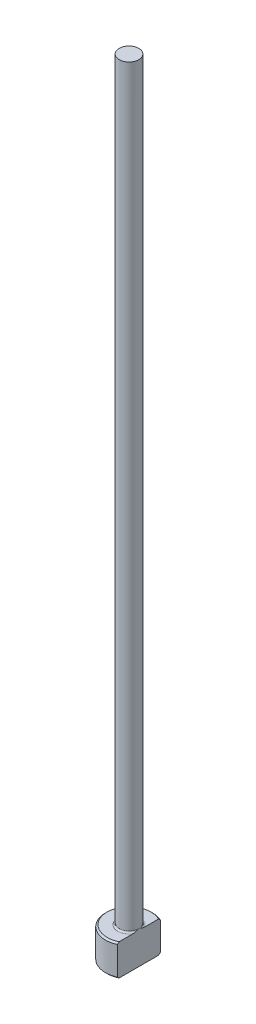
ISO-10303-21;
HEADER;
FILE_DESCRIPTION(('STEP AP214'),'2;1');
FILE_NAME('part.step','',(''),(''),'','','');
FILE_SCHEMA(('AUTOMOTIVE_DESIGN { 1 0 10303 214 1 1 1 1 }'));
ENDSEC;
DATA;
#1=APPLICATION_CONTEXT('core data for automotive mechanical design processes');
#2=APPLICATION_PROTOCOL_DEFINITION('international standard','automotive_design',2000,#1);
#3=PRODUCT_CONTEXT('',#1,'mechanical');
#4=PRODUCT('Part','Part','',(#3));
#5=PRODUCT_RELATED_PRODUCT_CATEGORY('part','',(#4));
#6=PRODUCT_DEFINITION_FORMATION('','',#4);
#7=PRODUCT_DEFINITION_CONTEXT('part definition',#1,'design');
#8=PRODUCT_DEFINITION('design','',#6,#7);
#9=PRODUCT_DEFINITION_SHAPE('','',#8);
#10=(LENGTH_UNIT() NAMED_UNIT(*) SI_UNIT(.MILLI.,.METRE.));
#11=(NAMED_UNIT(*) PLANE_ANGLE_UNIT() SI_UNIT($,.RADIAN.));
#12=(NAMED_UNIT(*) SI_UNIT($,.STERADIAN.) SOLID_ANGLE_UNIT());
#13=UNCERTAINTY_MEASURE_WITH_UNIT(LENGTH_MEASURE(1.E-05),#10,'distance_accuracy_value','');
#14=(GEOMETRIC_REPRESENTATION_CONTEXT(3) GLOBAL_UNCERTAINTY_ASSIGNED_CONTEXT((#13)) GLOBAL_UNIT_ASSIGNED_CONTEXT((#10,
#11,#12)) REPRESENTATION_CONTEXT('',''));
#15=CARTESIAN_POINT('',(0.,0.,0.));
#16=DIRECTION('',(0.,0.,1.));
#17=DIRECTION('',(1.,0.,0.));
#18=AXIS2_PLACEMENT_3D('',#15,#16,#17);
#19=CARTESIAN_POINT('',(0.,0.,0.));
#20=DIRECTION('',(0.,-1.,0.));
#21=DIRECTION('',(0.,0.,-1.));
#22=AXIS2_PLACEMENT_3D('',#19,#20,#21);
#23=PLANE('',#22);
#24=CARTESIAN_POINT('',(0.,0.,0.));
#25=DIRECTION('',(0.,-1.,0.));
#26=DIRECTION('',(0.,0.,-1.));
#27=AXIS2_PLACEMENT_3D('',#24,#25,#26);
#28=CIRCLE('',#27,2.79999999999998);
#29=CARTESIAN_POINT('',(1.24999999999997,0.,2.50549396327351));
#30=VERTEX_POINT('',#29);
#31=CARTESIAN_POINT('',(1.24999999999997,0.,-2.50549396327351));
#32=VERTEX_POINT('',#31);
#33=EDGE_CURVE('E98',#30,#32,#28,.T.);
#34=ORIENTED_EDGE('',*,*,#33,.T.);
#35=DIRECTION('',(0.,0.,1.));
#36=VECTOR('',#35,1.);
#37=CARTESIAN_POINT('',(1.24999999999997,0.,2.72717802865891));
#38=LINE('',#37,#36);
#39=EDGE_CURVE('E83',#32,#30,#38,.T.);
#40=ORIENTED_EDGE('',*,*,#39,.T.);
#41=EDGE_LOOP('',(#34,#40));
#42=FACE_BOUND('',#41,.T.);
#43=ADVANCED_FACE('F32',(#42),#23,.T.);
#44=CARTESIAN_POINT('',(0.,259.958771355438,0.));
#45=DIRECTION('',(0.,1.,0.));
#46=DIRECTION('',(0.,0.,1.));
#47=AXIS2_PLACEMENT_3D('',#44,#45,#46);
#48=CYLINDRICAL_SURFACE('',#47,2.99999999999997);
#49=CARTESIAN_POINT('',(0.,3.80000000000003,0.));
#50=DIRECTION('',(0.,1.,0.));
#51=DIRECTION('',(0.,0.,1.));
#52=AXIS2_PLACEMENT_3D('',#49,#50,#51);
#53=CIRCLE('',#52,2.99999999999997);
#54=CARTESIAN_POINT('',(1.24999999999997,3.80000000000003,2.72717802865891));
#55=VERTEX_POINT('',#54);
#56=CARTESIAN_POINT('',(1.24999999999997,3.80000000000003,-2.72717802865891));
#57=VERTEX_POINT('',#56);
#58=EDGE_CURVE('E104',#55,#57,#53,.F.);
#59=ORIENTED_EDGE('',*,*,#58,.T.);
#60=DIRECTION('',(0.,-1.,0.));
#61=VECTOR('',#60,1.);
#62=CARTESIAN_POINT('',(1.24999999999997,100.,-2.72717802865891));
#63=LINE('',#62,#61);
#64=CARTESIAN_POINT('',(1.24999999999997,0.199999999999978,-2.72717802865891));
#65=VERTEX_POINT('',#64);
#66=EDGE_CURVE('E183',#57,#65,#63,.T.);
#67=ORIENTED_EDGE('',*,*,#66,.T.);
#68=CARTESIAN_POINT('',(0.,0.199999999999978,0.));
#69=DIRECTION('',(0.,-1.,0.));
#70=DIRECTION('',(0.,0.,-1.));
#71=AXIS2_PLACEMENT_3D('',#68,#69,#70);
#72=CIRCLE('',#71,2.99999999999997);
#73=CARTESIAN_POINT('',(1.24999999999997,0.199999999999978,2.72717802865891));
#74=VERTEX_POINT('',#73);
#75=EDGE_CURVE('E100',#65,#74,#72,.F.);
#76=ORIENTED_EDGE('',*,*,#75,.T.);
#77=DIRECTION('',(0.,-1.,0.));
#78=VECTOR('',#77,1.);
#79=CARTESIAN_POINT('',(1.24999999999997,100.,2.72717802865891));
#80=LINE('',#79,#78);
#81=EDGE_CURVE('E93',#55,#74,#80,.T.);
#82=ORIENTED_EDGE('',*,*,#81,.F.);
#83=EDGE_LOOP('',(#59,#67,#76,#82));
#84=FACE_BOUND('',#83,.T.);
#85=ADVANCED_FACE('F158',(#84),#48,.T.);
#86=CARTESIAN_POINT('',(-2.99999999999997,4.,0.));
#87=DIRECTION('',(0.,1.,0.));
#88=DIRECTION('',(0.,0.,1.));
#89=AXIS2_PLACEMENT_3D('',#86,#87,#88);
#90=PLANE('',#89);
#91=CARTESIAN_POINT('',(0.,4.,0.));
#92=DIRECTION('',(0.,1.,0.));
#93=DIRECTION('',(0.,0.,1.));
#94=AXIS2_PLACEMENT_3D('',#91,#92,#93);
#95=CIRCLE('',#94,2.8);
#96=CARTESIAN_POINT('',(1.24999999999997,4.,-2.50549396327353));
#97=VERTEX_POINT('',#96);
#98=CARTESIAN_POINT('',(1.24999999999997,4.,2.50549396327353));
#99=VERTEX_POINT('',#98);
#100=EDGE_CURVE('E178',#97,#99,#95,.T.);
#101=ORIENTED_EDGE('',*,*,#100,.T.);
#102=DIRECTION('',(0.,0.,-1.));
#103=VECTOR('',#102,1.);
#104=CARTESIAN_POINT('',(1.24999999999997,4.,0.));
#105=LINE('',#104,#103);
#106=CARTESIAN_POINT('',(1.24999999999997,3.99999999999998,0.734846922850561));
#107=VERTEX_POINT('',#106);
#108=EDGE_CURVE('E57',#99,#107,#105,.T.);
#109=ORIENTED_EDGE('',*,*,#108,.T.);
#110=CARTESIAN_POINT('',(0.,4.,0.));
#111=DIRECTION('',(0.,1.,0.));
#112=DIRECTION('',(0.,0.,1.));
#113=AXIS2_PLACEMENT_3D('',#110,#111,#112);
#114=CIRCLE('',#113,1.44999999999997);
#115=CARTESIAN_POINT('',(1.24999999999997,3.99999999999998,-0.734846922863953));
#116=VERTEX_POINT('',#115);
#117=EDGE_CURVE('E107',#107,#116,#114,.F.);
#118=ORIENTED_EDGE('',*,*,#117,.T.);
#119=EDGE_CURVE('E136',#116,#97,#105,.T.);
#120=ORIENTED_EDGE('',*,*,#119,.T.);
#121=EDGE_LOOP('',(#101,#109,#118,#120));
#122=FACE_BOUND('',#121,.T.);
#123=ADVANCED_FACE('F147',(#122),#90,.T.);
#124=CARTESIAN_POINT('',(0.,4.,0.));
#125=DIRECTION('',(0.,-1.,0.));
#126=DIRECTION('',(0.,0.,-1.));
#127=AXIS2_PLACEMENT_3D('',#124,#125,#126);
#128=CONICAL_SURFACE('',#127,2.8,0.785398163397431);
#129=ORIENTED_EDGE('',*,*,#58,.F.);
#130=CARTESIAN_POINT('',(1.24999999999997,0.669029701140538,6.00219100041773));
#131=CARTESIAN_POINT('',(1.24999999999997,0.811608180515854,5.85654654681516));
#132=CARTESIAN_POINT('',(1.24999999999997,0.954083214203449,5.71080056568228));
#133=CARTESIAN_POINT('',(1.24999999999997,1.23900024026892,5.41878816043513));
#134=CARTESIAN_POINT('',(1.24999999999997,1.38144175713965,5.27252127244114));
#135=CARTESIAN_POINT('',(1.24999999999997,1.67009506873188,4.97540906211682));
#136=CARTESIAN_POINT('',(1.24999999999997,1.81629662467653,4.82455378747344));
#137=CARTESIAN_POINT('',(1.24999999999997,2.10796282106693,4.52263591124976));
#138=CARTESIAN_POINT('',(1.24999999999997,2.2534282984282,4.37157411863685));
#139=CARTESIAN_POINT('',(1.24999999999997,2.53664042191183,4.07620034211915));
#140=CARTESIAN_POINT('',(1.24999999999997,2.67441792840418,3.93191797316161));
#141=CARTESIAN_POINT('',(1.24999999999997,2.94919792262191,3.64255917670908));
#142=CARTESIAN_POINT('',(1.24999999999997,3.08620024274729,3.49748258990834));
#143=CARTESIAN_POINT('',(1.24999999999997,3.36003302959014,3.2052316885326));
#144=CARTESIAN_POINT('',(1.24999999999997,3.49685542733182,3.05804979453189));
#145=CARTESIAN_POINT('',(1.24999999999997,3.76866895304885,2.76222351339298));
#146=CARTESIAN_POINT('',(1.24999999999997,3.9036614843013,2.61358041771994));
#147=CARTESIAN_POINT('',(1.24999999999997,4.16725075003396,2.31803303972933));
#148=CARTESIAN_POINT('',(1.24999999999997,4.29592101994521,2.17119494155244));
#149=CARTESIAN_POINT('',(1.24999999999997,4.48585031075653,1.94789558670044));
#150=CARTESIAN_POINT('',(1.24999999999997,4.54874737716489,1.87283059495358));
#151=CARTESIAN_POINT('',(1.24999999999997,4.67301560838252,1.72146479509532));
#152=CARTESIAN_POINT('',(1.24999999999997,4.73438704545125,1.64516421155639));
#153=CARTESIAN_POINT('',(1.24999999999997,4.85417557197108,1.49197305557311));
#154=CARTESIAN_POINT('',(1.24999999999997,4.91262187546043,1.41510543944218));
#155=CARTESIAN_POINT('',(1.24999999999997,5.02658525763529,1.25910555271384));
#156=CARTESIAN_POINT('',(1.24999999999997,5.08209990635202,1.17997148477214));
#157=CARTESIAN_POINT('',(1.24999999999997,5.18831713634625,1.0191471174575));
#158=CARTESIAN_POINT('',(1.24999999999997,5.23904487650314,0.937473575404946));
#159=CARTESIAN_POINT('',(1.24999999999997,5.33341065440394,0.770163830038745));
#160=CARTESIAN_POINT('',(1.24999999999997,5.37706287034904,0.684536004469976));
#161=CARTESIAN_POINT('',(1.24999999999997,5.42311846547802,0.577571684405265));
#162=CARTESIAN_POINT('',(1.24999999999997,5.43098597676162,0.558575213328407));
#163=CARTESIAN_POINT('',(1.24999999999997,5.44613719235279,0.520340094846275));
#164=CARTESIAN_POINT('',(1.24999999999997,5.45342063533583,0.501101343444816));
#165=CARTESIAN_POINT('',(1.24999999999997,5.46734064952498,0.462392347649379));
#166=CARTESIAN_POINT('',(1.24999999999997,5.47397728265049,0.442922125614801));
#167=CARTESIAN_POINT('',(1.24999999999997,5.48654090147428,0.403756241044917));
#168=CARTESIAN_POINT('',(1.24999999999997,5.49246793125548,0.384060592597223));
#169=CARTESIAN_POINT('',(1.24999999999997,5.50889838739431,0.325328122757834));
#170=CARTESIAN_POINT('',(1.24999999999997,5.51829705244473,0.285972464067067));
#171=CARTESIAN_POINT('',(1.24999999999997,5.53364447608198,0.206573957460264));
#172=CARTESIAN_POINT('',(1.24999999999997,5.53959211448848,0.166530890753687));
#173=CARTESIAN_POINT('',(1.24999999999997,5.54775364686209,0.0853257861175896));
#174=CARTESIAN_POINT('',(1.24999999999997,5.54989812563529,0.0441566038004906));
#175=CARTESIAN_POINT('',(1.24999999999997,5.5500947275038,-0.0381787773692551));
#176=CARTESIAN_POINT('',(1.24999999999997,5.54814807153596,-0.0793449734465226));
#177=CARTESIAN_POINT('',(1.24999999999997,5.54028608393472,-0.161410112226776));
#178=CARTESIAN_POINT('',(1.24999999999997,5.53435930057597,-0.202307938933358));
#179=CARTESIAN_POINT('',(1.24999999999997,5.51889139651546,-0.283420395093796));
#180=CARTESIAN_POINT('',(1.24999999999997,5.50934853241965,-0.323634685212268));
#181=CARTESIAN_POINT('',(1.24999999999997,5.48253027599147,-0.419701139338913));
#182=CARTESIAN_POINT('',(1.24999999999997,5.46368943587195,-0.475114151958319));
#183=CARTESIAN_POINT('',(1.24999999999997,5.42119888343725,-0.584051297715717));
#184=CARTESIAN_POINT('',(1.24999999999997,5.39754618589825,-0.637574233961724));
#185=CARTESIAN_POINT('',(1.24999999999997,5.34650154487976,-0.743173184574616));
#186=CARTESIAN_POINT('',(1.24999999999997,5.31908834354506,-0.795238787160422));
#187=CARTESIAN_POINT('',(1.24999999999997,5.26156746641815,-0.897817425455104));
#188=CARTESIAN_POINT('',(1.24999999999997,5.23146075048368,-0.948331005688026));
#189=CARTESIAN_POINT('',(1.24999999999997,5.16421238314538,-1.05610178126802));
#190=CARTESIAN_POINT('',(1.24999999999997,5.12671791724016,-1.11313743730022));
#191=CARTESIAN_POINT('',(1.24999999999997,5.0497153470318,-1.22583866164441));
#192=CARTESIAN_POINT('',(1.24999999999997,5.01020681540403,-1.28150393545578));
#193=CARTESIAN_POINT('',(1.24999999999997,4.88938978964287,-1.44694956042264));
#194=CARTESIAN_POINT('',(1.24999999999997,4.80584655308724,-1.55509257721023));
#195=CARTESIAN_POINT('',(1.24999999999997,4.63502000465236,-1.76881938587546));
#196=CARTESIAN_POINT('',(1.24999999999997,4.54772710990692,-1.87439538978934));
#197=CARTESIAN_POINT('',(1.24999999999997,4.37088701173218,-2.08355531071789));
#198=CARTESIAN_POINT('',(1.24999999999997,4.28134083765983,-2.18714010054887));
#199=CARTESIAN_POINT('',(1.24999999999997,4.10042772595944,-2.39324626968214));
#200=CARTESIAN_POINT('',(1.24999999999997,4.0090561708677,-2.49576357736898));
#201=CARTESIAN_POINT('',(1.24999999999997,3.82518962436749,-2.69980391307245));
#202=CARTESIAN_POINT('',(1.24999999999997,3.73269451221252,-2.80132683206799));
#203=CARTESIAN_POINT('',(1.24999999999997,3.45429710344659,-3.10446128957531));
#204=CARTESIAN_POINT('',(1.24999999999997,3.26719139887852,-3.30496607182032));
#205=CARTESIAN_POINT('',(1.24999999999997,2.87989899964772,-3.71613563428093));
#206=CARTESIAN_POINT('',(1.24999999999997,2.67959819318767,-3.92669240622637));
#207=CARTESIAN_POINT('',(1.24999999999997,2.27757992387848,-4.34666060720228));
#208=CARTESIAN_POINT('',(1.24999999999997,2.07586177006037,-4.55607137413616));
#209=CARTESIAN_POINT('',(1.24999999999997,1.67356669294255,-4.97197982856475));
#210=CARTESIAN_POINT('',(1.24999999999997,1.47299831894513,-5.17848579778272));
#211=CARTESIAN_POINT('',(1.24999999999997,1.07135927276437,-5.59078665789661));
#212=CARTESIAN_POINT('',(1.24999999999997,0.870288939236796,-5.79658187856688));
#213=CARTESIAN_POINT('',(1.24999999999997,0.66902970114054,-6.00219100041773));
#214=B_SPLINE_CURVE_WITH_KNOTS('',3,(#130,#131,#132,#133,#134,#135,#136,#137,#138,#139,#140,
#141,#142,#143,#144,#145,#146,#147,#148,#149,#150,#151,#152,#153,#154,#155,#156,#157,#158,#159,
#160,#161,#162,#163,#164,#165,#166,#167,#168,#169,#170,#171,#172,#173,#174,#175,#176,#177,#178,
#179,#180,#181,#182,#183,#184,#185,#186,#187,#188,#189,#190,#191,#192,#193,#194,#195,#196,#197,
#198,#199,#200,#201,#202,#203,#204,#205,#206,#207,#208,#209,#210,#211,#212,#213),.UNSPECIFIED.,
.F.,.F.,(4,2,2,2,2,2,2,2,2,2,2,2,2,2,2,2,2,2,2,2,2,2,2,2,2,2,2,2,2,2,2,2,2,2,2,2,2,2,2,2,2,4),
(0.,0.611447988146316,1.22394436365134,1.85417356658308,2.4833135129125,3.08180969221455,
3.68043067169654,4.28328558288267,4.88564854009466,5.47129854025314,5.76508275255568,
6.05881415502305,6.3484612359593,6.63834474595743,6.92660821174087,7.21428670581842,
7.27596254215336,7.33766582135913,7.39936318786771,7.46105671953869,7.58229876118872,
7.70358013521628,7.82705319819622,7.9504894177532,8.07428232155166,8.19813498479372,
8.37340718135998,8.54878844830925,8.72520546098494,8.90155985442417,9.10626834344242,
9.31102044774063,9.72083602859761,10.1317697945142,10.5425191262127,10.9544882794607,
11.3665021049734,12.1892148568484,13.0610401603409,13.9333249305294,14.7969505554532,
15.660099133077),.UNSPECIFIED.);
#215=EDGE_CURVE('E135',#55,#99,#214,.T.);
#216=ORIENTED_EDGE('',*,*,#215,.T.);
#217=ORIENTED_EDGE('',*,*,#100,.F.);
#218=EDGE_CURVE('E127',#97,#57,#214,.T.);
#219=ORIENTED_EDGE('',*,*,#218,.T.);
#220=EDGE_LOOP('',(#129,#216,#217,#219));
#221=FACE_BOUND('',#220,.T.);
#222=ADVANCED_FACE('F143',(#221),#128,.T.);
#223=CARTESIAN_POINT('',(0.,0.199999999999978,0.));
#224=DIRECTION('',(0.,1.,0.));
#225=DIRECTION('',(0.,0.,1.));
#226=AXIS2_PLACEMENT_3D('',#223,#224,#225);
#227=CONICAL_SURFACE('',#226,2.99999999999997,0.785398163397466);
#228=ORIENTED_EDGE('',*,*,#75,.F.);
#229=CARTESIAN_POINT('',(1.24999999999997,3.33097029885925,-6.00219100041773));
#230=CARTESIAN_POINT('',(1.24999999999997,3.18839181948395,-5.85654654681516));
#231=CARTESIAN_POINT('',(1.24999999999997,3.04591678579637,-5.7108005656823));
#232=CARTESIAN_POINT('',(1.24999999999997,2.76099975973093,-5.41878816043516));
#233=CARTESIAN_POINT('',(1.24999999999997,2.61855824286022,-5.27252127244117));
#234=CARTESIAN_POINT('',(1.24999999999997,2.32990493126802,-4.97540906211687));
#235=CARTESIAN_POINT('',(1.24999999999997,2.18370337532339,-4.8245537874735));
#236=CARTESIAN_POINT('',(1.24999999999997,1.89203717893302,-4.52263591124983));
#237=CARTESIAN_POINT('',(1.24999999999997,1.74657170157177,-4.37157411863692));
#238=CARTESIAN_POINT('',(1.24999999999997,1.46335957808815,-4.07620034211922));
#239=CARTESIAN_POINT('',(1.24999999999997,1.32558207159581,-3.93191797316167));
#240=CARTESIAN_POINT('',(1.24999999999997,1.05080207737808,-3.64255917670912));
#241=CARTESIAN_POINT('',(1.24999999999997,0.913799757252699,-3.49748258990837));
#242=CARTESIAN_POINT('',(1.24999999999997,0.639966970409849,-3.20523168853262));
#243=CARTESIAN_POINT('',(1.24999999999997,0.503144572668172,-3.0580497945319));
#244=CARTESIAN_POINT('',(1.24999999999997,0.231331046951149,-2.76222351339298));
#245=CARTESIAN_POINT('',(1.24999999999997,0.0963385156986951,-2.61358041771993));
#246=CARTESIAN_POINT('',(1.24999999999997,-0.167250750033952,-2.3180330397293));
#247=CARTESIAN_POINT('',(1.24999999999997,-0.295921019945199,-2.17119494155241));
#248=CARTESIAN_POINT('',(1.24999999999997,-0.485850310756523,-1.94789558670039));
#249=CARTESIAN_POINT('',(1.24999999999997,-0.548747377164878,-1.87283059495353));
#250=CARTESIAN_POINT('',(1.24999999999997,-0.6730156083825,-1.72146479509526));
#251=CARTESIAN_POINT('',(1.24999999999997,-0.734387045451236,-1.64516421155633));
#252=CARTESIAN_POINT('',(1.24999999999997,-0.854175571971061,-1.49197305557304));
#253=CARTESIAN_POINT('',(1.24999999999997,-0.912621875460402,-1.41510543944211));
#254=CARTESIAN_POINT('',(1.24999999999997,-1.02658525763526,-1.25910555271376));
#255=CARTESIAN_POINT('',(1.24999999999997,-1.08209990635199,-1.17997148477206));
#256=CARTESIAN_POINT('',(1.24999999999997,-1.18831713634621,-1.01914711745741));
#257=CARTESIAN_POINT('',(1.24999999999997,-1.23904487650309,-0.937473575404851));
#258=CARTESIAN_POINT('',(1.24999999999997,-1.33341065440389,-0.770163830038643));
#259=CARTESIAN_POINT('',(1.24999999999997,-1.37706287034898,-0.684536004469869));
#260=CARTESIAN_POINT('',(1.24999999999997,-1.42311846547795,-0.577571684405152));
#261=CARTESIAN_POINT('',(1.24999999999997,-1.43098597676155,-0.558575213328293));
#262=CARTESIAN_POINT('',(1.24999999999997,-1.44613719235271,-0.520340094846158));
#263=CARTESIAN_POINT('',(1.24999999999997,-1.45342063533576,-0.501101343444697));
#264=CARTESIAN_POINT('',(1.24999999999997,-1.4673406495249,-0.462392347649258));
#265=CARTESIAN_POINT('',(1.24999999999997,-1.47397728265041,-0.442922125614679));
#266=CARTESIAN_POINT('',(1.24999999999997,-1.48654090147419,-0.403756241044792));
#267=CARTESIAN_POINT('',(1.24999999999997,-1.4924679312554,-0.384060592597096));
#268=CARTESIAN_POINT('',(1.24999999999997,-1.50889838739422,-0.325328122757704));
#269=CARTESIAN_POINT('',(1.24999999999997,-1.51829705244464,-0.285972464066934));
#270=CARTESIAN_POINT('',(1.24999999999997,-1.53364447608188,-0.206573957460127));
#271=CARTESIAN_POINT('',(1.24999999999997,-1.53959211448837,-0.166530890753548));
#272=CARTESIAN_POINT('',(1.24999999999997,-1.54775364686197,-0.0853257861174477));
#273=CARTESIAN_POINT('',(1.24999999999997,-1.54989812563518,-0.0441566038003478));
#274=CARTESIAN_POINT('',(1.24999999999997,-1.55009472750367,0.0381787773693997));
#275=CARTESIAN_POINT('',(1.24999999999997,-1.54814807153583,0.0793449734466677));
#276=CARTESIAN_POINT('',(1.24999999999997,-1.54028608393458,0.161410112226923));
#277=CARTESIAN_POINT('',(1.24999999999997,-1.53435930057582,0.202307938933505));
#278=CARTESIAN_POINT('',(1.24999999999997,-1.5188913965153,0.283420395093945));
#279=CARTESIAN_POINT('',(1.24999999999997,-1.50934853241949,0.323634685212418));
#280=CARTESIAN_POINT('',(1.24999999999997,-1.4825302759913,0.419701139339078));
#281=CARTESIAN_POINT('',(1.24999999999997,-1.46368943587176,0.475114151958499));
#282=CARTESIAN_POINT('',(1.24999999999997,-1.42119888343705,0.584051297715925));
#283=CARTESIAN_POINT('',(1.24999999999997,-1.39754618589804,0.637574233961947));
#284=CARTESIAN_POINT('',(1.24999999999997,-1.34650154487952,0.743173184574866));
#285=CARTESIAN_POINT('',(1.24999999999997,-1.31908834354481,0.795238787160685));
#286=CARTESIAN_POINT('',(1.24999999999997,-1.26156746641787,0.897817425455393));
#287=CARTESIAN_POINT('',(1.24999999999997,-1.2314607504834,0.948331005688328));
#288=CARTESIAN_POINT('',(1.24999999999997,-1.16421238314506,1.05610178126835));
#289=CARTESIAN_POINT('',(1.24999999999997,-1.12671791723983,1.11313743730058));
#290=CARTESIAN_POINT('',(1.24999999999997,-1.04971534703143,1.2258386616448));
#291=CARTESIAN_POINT('',(1.24999999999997,-1.01020681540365,1.28150393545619));
#292=CARTESIAN_POINT('',(1.24999999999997,-0.889389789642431,1.44694956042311));
#293=CARTESIAN_POINT('',(1.24999999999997,-0.805846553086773,1.55509257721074));
#294=CARTESIAN_POINT('',(1.24999999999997,-0.635020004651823,1.76881938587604));
#295=CARTESIAN_POINT('',(1.24999999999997,-0.547727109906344,1.87439538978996));
#296=CARTESIAN_POINT('',(1.24999999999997,-0.370887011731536,2.08355531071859));
#297=CARTESIAN_POINT('',(1.24999999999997,-0.281340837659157,2.18714010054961));
#298=CARTESIAN_POINT('',(1.24999999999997,-0.10042772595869,2.39324626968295));
#299=CARTESIAN_POINT('',(1.24999999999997,-0.0090561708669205,2.49576357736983));
#300=CARTESIAN_POINT('',(1.24999999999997,0.174810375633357,2.69980391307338));
#301=CARTESIAN_POINT('',(1.24999999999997,0.267305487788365,2.80132683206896));
#302=CARTESIAN_POINT('',(1.24999999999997,0.545702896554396,3.10446128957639));
#303=CARTESIAN_POINT('',(1.24999999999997,0.732808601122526,3.30496607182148));
#304=CARTESIAN_POINT('',(1.24999999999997,1.12010100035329,3.71613563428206));
#305=CARTESIAN_POINT('',(1.24999999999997,1.32040180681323,3.92669240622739));
#306=CARTESIAN_POINT('',(1.24999999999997,1.72242007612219,4.34666060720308));
#307=CARTESIAN_POINT('',(1.24999999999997,1.92413822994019,4.55607137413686));
#308=CARTESIAN_POINT('',(1.24999999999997,2.32643330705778,4.97197982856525));
#309=CARTESIAN_POINT('',(1.24999999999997,2.5270016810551,5.17848579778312));
#310=CARTESIAN_POINT('',(1.24999999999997,2.92864072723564,5.59078665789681));
#311=CARTESIAN_POINT('',(1.24999999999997,3.1297110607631,5.79658187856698));
#312=CARTESIAN_POINT('',(1.24999999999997,3.33097029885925,6.00219100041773));
#313=B_SPLINE_CURVE_WITH_KNOTS('',3,(#229,#230,#231,#232,#233,#234,#235,#236,#237,#238,#239,
#240,#241,#242,#243,#244,#245,#246,#247,#248,#249,#250,#251,#252,#253,#254,#255,#256,#257,#258,
#259,#260,#261,#262,#263,#264,#265,#266,#267,#268,#269,#270,#271,#272,#273,#274,#275,#276,#277,
#278,#279,#280,#281,#282,#283,#284,#285,#286,#287,#288,#289,#290,#291,#292,#293,#294,#295,#296,
#297,#298,#299,#300,#301,#302,#303,#304,#305,#306,#307,#308,#309,#310,#311,#312),.UNSPECIFIED.,
.F.,.F.,(4,2,2,2,2,2,2,2,2,2,2,2,2,2,2,2,2,2,2,2,2,2,2,2,2,2,2,2,2,2,2,2,2,2,2,2,2,2,2,2,2,4),
(0.,0.611447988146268,1.22394436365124,1.85417356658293,2.48331351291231,3.08180969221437,
3.68043067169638,4.28328558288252,4.88564854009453,5.47129854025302,5.76508275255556,
6.05881415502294,6.3484612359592,6.63834474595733,6.92660821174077,7.21428670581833,
7.27596254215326,7.33766582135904,7.39936318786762,7.46105671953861,7.58229876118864,
7.7035801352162,7.82705319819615,7.95048941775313,8.07428232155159,8.19813498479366,
8.37340718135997,8.54878844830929,8.72520546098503,8.90155985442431,9.10626834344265,
9.31102044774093,9.72083602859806,10.1317697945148,10.5425191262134,10.9544882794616,
11.3665021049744,12.1892148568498,13.0610401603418,13.9333249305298,14.7969505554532,
15.6600991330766),.UNSPECIFIED.);
#314=EDGE_CURVE('E86',#65,#32,#313,.T.);
#315=ORIENTED_EDGE('',*,*,#314,.T.);
#316=ORIENTED_EDGE('',*,*,#33,.F.);
#317=EDGE_CURVE('E89',#30,#74,#313,.T.);
#318=ORIENTED_EDGE('',*,*,#317,.T.);
#319=EDGE_LOOP('',(#228,#315,#316,#318));
#320=FACE_BOUND('',#319,.T.);
#321=ADVANCED_FACE('F97',(#320),#227,.T.);
#322=CARTESIAN_POINT('',(0.,4.19999999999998,0.));
#323=DIRECTION('',(0.,1.,0.));
#324=DIRECTION('',(0.,0.,1.));
#325=AXIS2_PLACEMENT_3D('',#322,#323,#324);
#326=TOROIDAL_SURFACE('',#325,1.44999999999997,0.2);
#327=CARTESIAN_POINT('',(1.24999999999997,4.19999999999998,0.));
#328=CARTESIAN_POINT('',(1.24999999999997,4.20000051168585,-1.97679442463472E-10));
#329=CARTESIAN_POINT('',(1.24999999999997,4.2000010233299,-1.08908064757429E-07));
#330=CARTESIAN_POINT('',(1.24999999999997,4.2000020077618,-4.52594763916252E-07));
#331=CARTESIAN_POINT('',(1.24999999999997,4.20000247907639,-6.9099304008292E-07));
#332=CARTESIAN_POINT('',(1.24999999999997,4.20000341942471,-1.26357943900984E-06));
#333=CARTESIAN_POINT('',(1.24999999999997,4.20000388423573,-1.60457618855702E-06));
#334=CARTESIAN_POINT('',(1.24999999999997,4.20000476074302,-2.3395490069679E-06));
#335=CARTESIAN_POINT('',(1.24999999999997,4.20000517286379,-2.73304148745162E-06));
#336=CARTESIAN_POINT('',(1.24999999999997,4.20000655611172,-4.1454401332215E-06));
#337=CARTESIAN_POINT('',(1.24999999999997,4.20000745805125,-5.23310092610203E-06));
#338=CARTESIAN_POINT('',(1.24999999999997,4.20000906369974,-7.47950361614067E-06));
#339=CARTESIAN_POINT('',(1.24999999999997,4.20000977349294,-8.63414438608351E-06));
#340=CARTESIAN_POINT('',(1.24999999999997,4.20001244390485,-1.31453477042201E-05));
#341=CARTESIAN_POINT('',(1.24999999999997,4.20001426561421,-1.65880555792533E-05));
#342=CARTESIAN_POINT('',(1.24999999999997,4.20001724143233,-2.33729029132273E-05));
#343=CARTESIAN_POINT('',(1.24999999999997,4.20001844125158,-2.66956154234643E-05));
#344=CARTESIAN_POINT('',(1.24999999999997,4.20002354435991,-4.08635086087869E-05));
#345=CARTESIAN_POINT('',(1.24999999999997,4.2000274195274,-5.17114614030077E-05));
#346=CARTESIAN_POINT('',(1.24999999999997,4.2000336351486,-7.2005767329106E-05));
#347=CARTESIAN_POINT('',(1.24999999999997,4.2000361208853,-8.14057065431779E-05));
#348=CARTESIAN_POINT('',(1.24999999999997,4.20005581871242,-0.00014978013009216));
#349=CARTESIAN_POINT('',(1.24999999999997,4.20008094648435,-0.000206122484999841));
#350=CARTESIAN_POINT('',(1.24999999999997,4.20017507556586,-0.000425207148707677));
#351=CARTESIAN_POINT('',(1.24999999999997,4.20023819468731,-0.000589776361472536));
#352=CARTESIAN_POINT('',(1.24999999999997,4.20048692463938,-0.00122878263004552));
#353=CARTESIAN_POINT('',(1.24999999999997,4.20067870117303,-0.00170134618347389));
#354=CARTESIAN_POINT('',(1.24999999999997,4.20146022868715,-0.00363636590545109));
#355=CARTESIAN_POINT('',(1.24999999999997,4.20204298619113,-0.0051009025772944));
#356=CARTESIAN_POINT('',(1.24999999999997,4.20939719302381,-0.0235712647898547));
#357=CARTESIAN_POINT('',(1.24999999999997,4.21621259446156,-0.0405643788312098));
#358=CARTESIAN_POINT('',(1.24999999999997,4.22951000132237,-0.0739606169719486));
#359=CARTESIAN_POINT('',(1.24999999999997,4.23599508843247,-0.0903626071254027));
#360=CARTESIAN_POINT('',(1.24999999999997,4.24961430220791,-0.12511129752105));
#361=CARTESIAN_POINT('',(1.24999999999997,4.25673641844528,-0.143462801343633));
#362=CARTESIAN_POINT('',(1.24999999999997,4.27085039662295,-0.180427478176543));
#363=CARTESIAN_POINT('',(1.24999999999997,4.27784022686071,-0.199041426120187));
#364=CARTESIAN_POINT('',(1.24999999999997,4.29479134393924,-0.245221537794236));
#365=CARTESIAN_POINT('',(1.24999999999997,4.30459026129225,-0.272848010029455));
#366=CARTESIAN_POINT('',(1.24999999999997,4.32310234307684,-0.327738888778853));
#367=CARTESIAN_POINT('',(1.24999999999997,4.3318356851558,-0.354996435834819));
#368=CARTESIAN_POINT('',(1.24999999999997,4.34936561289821,-0.413744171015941));
#369=CARTESIAN_POINT('',(1.24999999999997,4.35799470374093,-0.445285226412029));
#370=CARTESIAN_POINT('',(1.24999999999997,4.37338463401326,-0.50909191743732));
#371=CARTESIAN_POINT('',(1.24999999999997,4.38013036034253,-0.541361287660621));
#372=CARTESIAN_POINT('',(1.24999999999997,4.39136059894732,-0.608339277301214));
#373=CARTESIAN_POINT('',(1.24999999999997,4.39568167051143,-0.643076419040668));
#374=CARTESIAN_POINT('',(1.24999999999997,4.40037605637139,-0.712733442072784));
#375=CARTESIAN_POINT('',(1.24999999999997,4.40076553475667,-0.747651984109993));
#376=CARTESIAN_POINT('',(1.24999999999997,4.39677668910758,-0.808103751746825));
#377=CARTESIAN_POINT('',(1.24999999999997,4.39361441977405,-0.833711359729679));
#378=CARTESIAN_POINT('',(1.24999999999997,4.38355990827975,-0.883915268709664));
#379=CARTESIAN_POINT('',(1.24999999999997,4.37671813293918,-0.908520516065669));
#380=CARTESIAN_POINT('',(1.24999999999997,4.36252570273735,-0.944879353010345));
#381=CARTESIAN_POINT('',(1.24999999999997,4.35688428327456,-0.957298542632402));
#382=CARTESIAN_POINT('',(1.24999999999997,4.34399066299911,-0.981318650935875));
#383=CARTESIAN_POINT('',(1.24999999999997,4.33673636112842,-0.992918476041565));
#384=CARTESIAN_POINT('',(1.24999999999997,4.32199744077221,-1.01267533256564));
#385=CARTESIAN_POINT('',(1.24999999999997,4.31482723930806,-1.02106482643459));
#386=CARTESIAN_POINT('',(1.24999999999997,4.29924321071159,-1.03659690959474));
#387=CARTESIAN_POINT('',(1.24999999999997,4.29083198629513,-1.04374204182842));
#388=CARTESIAN_POINT('',(1.24999999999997,4.27498600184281,-1.05478694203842));
#389=CARTESIAN_POINT('',(1.24999999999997,4.26780814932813,-1.059053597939));
#390=CARTESIAN_POINT('',(1.24999999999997,4.25284782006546,-1.06635953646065));
#391=CARTESIAN_POINT('',(1.24999999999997,4.24506572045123,-1.06939957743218));
#392=CARTESIAN_POINT('',(1.24999999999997,4.22901828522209,-1.07404931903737));
#393=CARTESIAN_POINT('',(1.24999999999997,4.22074990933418,-1.07564870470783));
#394=CARTESIAN_POINT('',(1.24999999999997,4.20405985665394,-1.07723717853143));
#395=CARTESIAN_POINT('',(1.24999999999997,4.19563825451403,-1.07722703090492));
#396=CARTESIAN_POINT('',(1.24999999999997,4.17988128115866,-1.07569157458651));
#397=CARTESIAN_POINT('',(1.24999999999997,4.17252879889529,-1.0743339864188));
#398=CARTESIAN_POINT('',(1.24999999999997,4.15814333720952,-1.07044616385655));
#399=CARTESIAN_POINT('',(1.24999999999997,4.15111040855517,-1.06791574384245));
#400=CARTESIAN_POINT('',(1.24999999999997,4.13724955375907,-1.06171920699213));
#401=CARTESIAN_POINT('',(1.24999999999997,4.13043935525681,-1.05801386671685));
#402=CARTESIAN_POINT('',(1.24999999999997,4.11740316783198,-1.04969609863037));
#403=CARTESIAN_POINT('',(1.24999999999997,4.11117742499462,-1.04508329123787));
#404=CARTESIAN_POINT('',(1.24999999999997,4.09586196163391,-1.03220341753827));
#405=CARTESIAN_POINT('',(1.24999999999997,4.08723799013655,-1.02338140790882));
#406=CARTESIAN_POINT('',(1.24999999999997,4.07148817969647,-1.00448021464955));
#407=CARTESIAN_POINT('',(1.24999999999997,4.0643671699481,-0.994397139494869));
#408=CARTESIAN_POINT('',(1.24999999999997,4.04800089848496,-0.967694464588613));
#409=CARTESIAN_POINT('',(1.24999999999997,4.0397014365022,-0.950498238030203));
#410=CARTESIAN_POINT('',(1.24999999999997,4.02582422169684,-0.915117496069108));
#411=CARTESIAN_POINT('',(1.24999999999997,4.02024415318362,-0.896933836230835));
#412=CARTESIAN_POINT('',(1.24999999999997,4.00805724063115,-0.84678106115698));
#413=CARTESIAN_POINT('',(1.24999999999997,4.00359525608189,-0.814297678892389));
#414=CARTESIAN_POINT('',(1.24999999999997,3.99933348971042,-0.748574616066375));
#415=CARTESIAN_POINT('',(1.24999999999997,3.99961552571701,-0.715331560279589));
#416=CARTESIAN_POINT('',(1.24999999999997,4.00446632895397,-0.637920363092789));
#417=CARTESIAN_POINT('',(1.24999999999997,4.0104488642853,-0.593849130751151));
#418=CARTESIAN_POINT('',(1.24999999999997,4.02681929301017,-0.506401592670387));
#419=CARTESIAN_POINT('',(1.24999999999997,4.03722697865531,-0.463029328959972));
#420=CARTESIAN_POINT('',(1.24999999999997,4.06007158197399,-0.380638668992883));
#421=CARTESIAN_POINT('',(1.24999999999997,4.07227412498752,-0.341553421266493));
#422=CARTESIAN_POINT('',(1.24999999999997,4.09824323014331,-0.264347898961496));
#423=CARTESIAN_POINT('',(1.24999999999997,4.11199311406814,-0.226221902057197));
#424=CARTESIAN_POINT('',(1.24999999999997,4.13108825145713,-0.175350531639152));
#425=CARTESIAN_POINT('',(1.24999999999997,4.13599999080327,-0.162438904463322));
#426=CARTESIAN_POINT('',(1.24999999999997,4.14604281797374,-0.136318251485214));
#427=CARTESIAN_POINT('',(1.24999999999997,4.15117629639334,-0.123110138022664));
#428=CARTESIAN_POINT('',(1.24999999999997,4.163417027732,-0.0918425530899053));
#429=CARTESIAN_POINT('',(1.24999999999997,4.1705525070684,-0.0737943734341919));
#430=CARTESIAN_POINT('',(1.24999999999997,4.18426943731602,-0.0393586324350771));
#431=CARTESIAN_POINT('',(1.24999999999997,4.19084281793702,-0.0229681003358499));
#432=CARTESIAN_POINT('',(1.24999999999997,4.19795564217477,-0.00510438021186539));
#433=CARTESIAN_POINT('',(1.24999999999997,4.19853702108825,-0.00364331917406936));
#434=CARTESIAN_POINT('',(1.24999999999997,4.19931818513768,-0.0017091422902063));
#435=CARTESIAN_POINT('',(1.24999999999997,4.1995110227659,-0.00123396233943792));
#436=CARTESIAN_POINT('',(1.24999999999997,4.1997610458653,-0.000591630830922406));
#437=CARTESIAN_POINT('',(1.24999999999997,4.19982443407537,-0.000426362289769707));
#438=CARTESIAN_POINT('',(1.24999999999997,4.19991892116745,-0.0002064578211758));
#439=CARTESIAN_POINT('',(1.24999999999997,4.19994410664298,-0.000149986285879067));
#440=CARTESIAN_POINT('',(1.24999999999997,4.19996383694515,-8.14647488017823E-05));
#441=CARTESIAN_POINT('',(1.24999999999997,4.19996632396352,-7.2055156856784E-05));
#442=CARTESIAN_POINT('',(1.24999999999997,4.19997254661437,-5.17396177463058E-05));
#443=CARTESIAN_POINT('',(1.24999999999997,4.19997642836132,-4.08803464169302E-05));
#444=CARTESIAN_POINT('',(1.24999999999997,4.19998153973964,-2.66997573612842E-05));
#445=CARTESIAN_POINT('',(1.24999999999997,4.19998274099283,-2.33755458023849E-05));
#446=CARTESIAN_POINT('',(1.24999999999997,4.1999857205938,-1.65878758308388E-05));
#447=CARTESIAN_POINT('',(1.24999999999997,4.19998754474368,-1.3143899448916E-05));
#448=CARTESIAN_POINT('',(1.24999999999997,4.19999021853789,-8.63150514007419E-06));
#449=CARTESIAN_POINT('',(1.24999999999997,4.19999092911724,-7.47674883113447E-06));
#450=CARTESIAN_POINT('',(1.24999999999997,4.19999253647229,-5.23027083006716E-06));
#451=CARTESIAN_POINT('',(1.24999999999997,4.19999343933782,-4.14265823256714E-06));
#452=CARTESIAN_POINT('',(1.24999999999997,4.19999482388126,-2.73051192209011E-06));
#453=CARTESIAN_POINT('',(1.24999999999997,4.19999523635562,-2.33712919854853E-06));
#454=CARTESIAN_POINT('',(1.24999999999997,4.19999611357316,-1.60243918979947E-06));
#455=CARTESIAN_POINT('',(1.24999999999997,4.19999657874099,-1.26161621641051E-06));
#456=CARTESIAN_POINT('',(1.24999999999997,4.19999751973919,-6.89449599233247E-07));
#457=CARTESIAN_POINT('',(1.24999999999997,4.19999799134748,-4.51288703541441E-07));
#458=CARTESIAN_POINT('',(1.24999999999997,4.19999897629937,-1.08178111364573E-07));
#459=CARTESIAN_POINT('',(1.24999999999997,4.1999994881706,1.97734883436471E-10));
#460=CARTESIAN_POINT('',(1.24999999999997,4.19999999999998,0.));
#461=B_SPLINE_CURVE_WITH_KNOTS('',3,(#327,#328,#329,#330,#331,#332,#333,#334,#335,#336,#337,
#338,#339,#340,#341,#342,#343,#344,#345,#346,#347,#348,#349,#350,#351,#352,#353,#354,#355,#356,
#357,#358,#359,#360,#361,#362,#363,#364,#365,#366,#367,#368,#369,#370,#371,#372,#373,#374,#375,
#376,#377,#378,#379,#380,#381,#382,#383,#384,#385,#386,#387,#388,#389,#390,#391,#392,#393,#394,
#395,#396,#397,#398,#399,#400,#401,#402,#403,#404,#405,#406,#407,#408,#409,#410,#411,#412,#413,
#414,#415,#416,#417,#418,#419,#420,#421,#422,#423,#424,#425,#426,#427,#428,#429,#430,#431,#432,
#433,#434,#435,#436,#437,#438,#439,#440,#441,#442,#443,#444,#445,#446,#447,#448,#449,#450,#451,
#452,#453,#454,#455,#456,#457,#458,#459,#460),.UNSPECIFIED.,.T.,.F.,(4,2,2,2,2,2,2,2,2,2,2,2,2,
2,2,2,2,2,2,2,2,2,2,2,2,2,2,2,2,2,2,2,2,2,2,2,2,2,2,2,2,2,2,2,2,2,2,2,2,2,2,2,2,2,2,2,2,2,2,2,2,
2,2,2,2,2,4),(0.,1.53427573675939E-06,3.11115055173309E-06,4.83351634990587E-06,
6.54098944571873E-06,1.07594293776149E-05,1.48222851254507E-05,2.64707313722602E-05,
3.70576288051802E-05,7.16088726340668E-05,0.000100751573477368,0.000285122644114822,
0.000814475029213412,0.00234373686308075,0.00707317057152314,0.0619940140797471,
0.114907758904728,0.173961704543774,0.233609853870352,0.321537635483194,0.407388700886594,
0.505443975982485,0.604264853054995,0.709126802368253,0.813557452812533,0.890773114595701,
0.96695575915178,1.0077884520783,1.04867465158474,1.08167318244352,1.11460346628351,
1.13955805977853,1.16449720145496,1.18961351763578,1.21471790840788,1.23704542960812,
1.25937648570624,1.28254952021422,1.30573226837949,1.34253218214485,1.3794485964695,
1.43640829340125,1.49331940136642,1.591136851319,1.69064301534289,1.82371118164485,
1.95738088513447,2.08016146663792,2.20172662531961,2.24316968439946,2.28568093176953,
2.34390494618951,2.39687801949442,2.4015962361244,2.40313396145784,2.40366556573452,
2.40385035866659,2.40387953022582,2.40391411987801,2.40392471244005,2.40393636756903,
2.40394043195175,2.4039446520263,2.40394636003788,2.40394808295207,2.40394966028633,
2.40395119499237),.UNSPECIFIED.);
#462=CARTESIAN_POINT('',(1.24999999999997,4.19999999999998,0.));
#463=VERTEX_POINT('',#462);
#464=EDGE_CURVE('E11',#116,#463,#461,.T.);
#465=ORIENTED_EDGE('',*,*,#464,.F.);
#466=ORIENTED_EDGE('',*,*,#117,.F.);
#467=CARTESIAN_POINT('',(1.24999999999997,4.19999999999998,0.));
#468=CARTESIAN_POINT('',(1.24999999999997,4.19999948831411,1.97679415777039E-10));
#469=CARTESIAN_POINT('',(1.24999999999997,4.19999897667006,1.08908064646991E-07));
#470=CARTESIAN_POINT('',(1.24999999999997,4.19999799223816,4.52594763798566E-07));
#471=CARTESIAN_POINT('',(1.24999999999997,4.19999752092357,6.90993040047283E-07));
#472=CARTESIAN_POINT('',(1.24999999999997,4.19999658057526,1.26357943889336E-06));
#473=CARTESIAN_POINT('',(1.24999999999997,4.19999611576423,1.60457618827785E-06));
#474=CARTESIAN_POINT('',(1.24999999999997,4.19999523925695,2.33954900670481E-06));
#475=CARTESIAN_POINT('',(1.24999999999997,4.19999482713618,2.73304148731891E-06));
#476=CARTESIAN_POINT('',(1.24999999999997,4.19999344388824,4.14544013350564E-06));
#477=CARTESIAN_POINT('',(1.24999999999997,4.19999254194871,5.23310092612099E-06));
#478=CARTESIAN_POINT('',(1.24999999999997,4.19999093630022,7.47950361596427E-06));
#479=CARTESIAN_POINT('',(1.24999999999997,4.19999022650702,8.6341443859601E-06));
#480=CARTESIAN_POINT('',(1.24999999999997,4.19998755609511,1.31453477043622E-05));
#481=CARTESIAN_POINT('',(1.24999999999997,4.19998573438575,1.65880555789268E-05));
#482=CARTESIAN_POINT('',(1.24999999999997,4.19998275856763,2.33729029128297E-05));
#483=CARTESIAN_POINT('',(1.24999999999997,4.19998155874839,2.66956154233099E-05));
#484=CARTESIAN_POINT('',(1.24999999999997,4.19997645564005,4.08635086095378E-05));
#485=CARTESIAN_POINT('',(1.24999999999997,4.19997258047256,5.17114614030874E-05));
#486=CARTESIAN_POINT('',(1.24999999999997,4.19996636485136,7.200576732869E-05));
#487=CARTESIAN_POINT('',(1.24999999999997,4.19996387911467,8.14057065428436E-05));
#488=CARTESIAN_POINT('',(1.24999999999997,4.19994418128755,0.000149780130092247));
#489=CARTESIAN_POINT('',(1.24999999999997,4.19991905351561,0.000206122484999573));
#490=CARTESIAN_POINT('',(1.24999999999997,4.1998249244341,0.000425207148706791));
#491=CARTESIAN_POINT('',(1.24999999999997,4.19976180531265,0.000589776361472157));
#492=CARTESIAN_POINT('',(1.24999999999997,4.19951307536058,0.00122878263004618));
#493=CARTESIAN_POINT('',(1.24999999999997,4.19932129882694,0.00170134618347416));
#494=CARTESIAN_POINT('',(1.24999999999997,4.19853977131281,0.00363636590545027));
#495=CARTESIAN_POINT('',(1.24999999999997,4.19795701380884,0.00510090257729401));
#496=CARTESIAN_POINT('',(1.24999999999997,4.19060280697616,0.0235712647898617));
#497=CARTESIAN_POINT('',(1.24999999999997,4.18378740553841,0.0405643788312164));
#498=CARTESIAN_POINT('',(1.24999999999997,4.17048999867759,0.0739606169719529));
#499=CARTESIAN_POINT('',(1.24999999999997,4.16400491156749,0.090362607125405));
#500=CARTESIAN_POINT('',(1.24999999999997,4.15038569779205,0.125111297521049));
#501=CARTESIAN_POINT('',(1.24999999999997,4.14326358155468,0.143462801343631));
#502=CARTESIAN_POINT('',(1.24999999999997,4.12914960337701,0.180427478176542));
#503=CARTESIAN_POINT('',(1.24999999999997,4.12215977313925,0.199041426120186));
#504=CARTESIAN_POINT('',(1.24999999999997,4.10520865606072,0.245221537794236));
#505=CARTESIAN_POINT('',(1.24999999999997,4.09540973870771,0.272848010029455));
#506=CARTESIAN_POINT('',(1.24999999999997,4.07689765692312,0.327738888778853));
#507=CARTESIAN_POINT('',(1.24999999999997,4.06816431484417,0.354996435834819));
#508=CARTESIAN_POINT('',(1.24999999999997,4.05063438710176,0.413744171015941));
#509=CARTESIAN_POINT('',(1.24999999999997,4.04200529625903,0.445285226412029));
#510=CARTESIAN_POINT('',(1.24999999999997,4.0266153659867,0.50909191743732));
#511=CARTESIAN_POINT('',(1.24999999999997,4.01986963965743,0.541361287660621));
#512=CARTESIAN_POINT('',(1.24999999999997,4.00863940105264,0.608339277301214));
#513=CARTESIAN_POINT('',(1.24999999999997,4.00431832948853,0.643076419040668));
#514=CARTESIAN_POINT('',(1.24999999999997,3.99962394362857,0.712733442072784));
#515=CARTESIAN_POINT('',(1.24999999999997,3.99923446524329,0.747651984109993));
#516=CARTESIAN_POINT('',(1.24999999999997,4.00322331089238,0.808103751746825));
#517=CARTESIAN_POINT('',(1.24999999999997,4.00638558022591,0.833711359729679));
#518=CARTESIAN_POINT('',(1.24999999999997,4.01644009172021,0.883915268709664));
#519=CARTESIAN_POINT('',(1.24999999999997,4.02328186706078,0.908520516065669));
#520=CARTESIAN_POINT('',(1.24999999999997,4.03747429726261,0.944879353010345));
#521=CARTESIAN_POINT('',(1.24999999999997,4.0431157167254,0.957298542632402));
#522=CARTESIAN_POINT('',(1.24999999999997,4.05600933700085,0.981318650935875));
#523=CARTESIAN_POINT('',(1.24999999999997,4.06326363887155,0.992918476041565));
#524=CARTESIAN_POINT('',(1.24999999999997,4.07800255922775,1.01267533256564));
#525=CARTESIAN_POINT('',(1.24999999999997,4.08517276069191,1.02106482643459));
#526=CARTESIAN_POINT('',(1.24999999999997,4.10075678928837,1.03659690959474));
#527=CARTESIAN_POINT('',(1.24999999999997,4.10916801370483,1.04374204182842));
#528=CARTESIAN_POINT('',(1.24999999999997,4.12501399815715,1.05478694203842));
#529=CARTESIAN_POINT('',(1.24999999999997,4.13219185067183,1.059053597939));
#530=CARTESIAN_POINT('',(1.24999999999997,4.1471521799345,1.06635953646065));
#531=CARTESIAN_POINT('',(1.24999999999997,4.15493427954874,1.06939957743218));
#532=CARTESIAN_POINT('',(1.24999999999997,4.17098171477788,1.07404931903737));
#533=CARTESIAN_POINT('',(1.24999999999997,4.17925009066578,1.07564870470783));
#534=CARTESIAN_POINT('',(1.24999999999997,4.19594014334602,1.07723717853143));
#535=CARTESIAN_POINT('',(1.24999999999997,4.20436174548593,1.07722703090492));
#536=CARTESIAN_POINT('',(1.24999999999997,4.2201187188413,1.07569157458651));
#537=CARTESIAN_POINT('',(1.24999999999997,4.22747120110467,1.0743339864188));
#538=CARTESIAN_POINT('',(1.24999999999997,4.24185666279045,1.07044616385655));
#539=CARTESIAN_POINT('',(1.24999999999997,4.24888959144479,1.06791574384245));
#540=CARTESIAN_POINT('',(1.24999999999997,4.26275044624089,1.06171920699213));
#541=CARTESIAN_POINT('',(1.24999999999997,4.26956064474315,1.05801386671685));
#542=CARTESIAN_POINT('',(1.24999999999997,4.28259683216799,1.04969609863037));
#543=CARTESIAN_POINT('',(1.24999999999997,4.28882257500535,1.04508329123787));
#544=CARTESIAN_POINT('',(1.24999999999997,4.30413803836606,1.03220341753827));
#545=CARTESIAN_POINT('',(1.24999999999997,4.31276200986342,1.02338140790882));
#546=CARTESIAN_POINT('',(1.24999999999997,4.32851182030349,1.00448021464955));
#547=CARTESIAN_POINT('',(1.24999999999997,4.33563283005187,0.994397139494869));
#548=CARTESIAN_POINT('',(1.24999999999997,4.351999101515,0.967694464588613));
#549=CARTESIAN_POINT('',(1.24999999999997,4.36029856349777,0.950498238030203));
#550=CARTESIAN_POINT('',(1.24999999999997,4.37417577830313,0.915117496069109));
#551=CARTESIAN_POINT('',(1.24999999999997,4.37975584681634,0.896933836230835));
#552=CARTESIAN_POINT('',(1.24999999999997,4.39194275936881,0.84678106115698));
#553=CARTESIAN_POINT('',(1.24999999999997,4.39640474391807,0.814297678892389));
#554=CARTESIAN_POINT('',(1.24999999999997,4.40066651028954,0.748574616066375));
#555=CARTESIAN_POINT('',(1.24999999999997,4.40038447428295,0.715331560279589));
#556=CARTESIAN_POINT('',(1.24999999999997,4.395533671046,0.637920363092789));
#557=CARTESIAN_POINT('',(1.24999999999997,4.38955113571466,0.593849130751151));
#558=CARTESIAN_POINT('',(1.24999999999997,4.3731807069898,0.506401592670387));
#559=CARTESIAN_POINT('',(1.24999999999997,4.36277302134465,0.463029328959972));
#560=CARTESIAN_POINT('',(1.24999999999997,4.33992841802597,0.380638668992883));
#561=CARTESIAN_POINT('',(1.24999999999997,4.32772587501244,0.341553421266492));
#562=CARTESIAN_POINT('',(1.24999999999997,4.30175676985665,0.264347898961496));
#563=CARTESIAN_POINT('',(1.24999999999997,4.28800688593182,0.226221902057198));
#564=CARTESIAN_POINT('',(1.24999999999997,4.26891174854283,0.175350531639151));
#565=CARTESIAN_POINT('',(1.24999999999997,4.26400000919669,0.162438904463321));
#566=CARTESIAN_POINT('',(1.24999999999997,4.25395718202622,0.136318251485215));
#567=CARTESIAN_POINT('',(1.24999999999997,4.24882370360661,0.123110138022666));
#568=CARTESIAN_POINT('',(1.24999999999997,4.23658297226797,0.0918425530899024));
#569=CARTESIAN_POINT('',(1.24999999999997,4.22944749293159,0.0737943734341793));
#570=CARTESIAN_POINT('',(1.24999999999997,4.21573056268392,0.0393586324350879));
#571=CARTESIAN_POINT('',(1.24999999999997,4.20915718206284,0.0229681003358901));
#572=CARTESIAN_POINT('',(1.24999999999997,4.2020443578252,0.0051043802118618));
#573=CARTESIAN_POINT('',(1.24999999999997,4.20146297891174,0.00364331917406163));
#574=CARTESIAN_POINT('',(1.24999999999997,4.20068181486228,0.00170914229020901));
#575=CARTESIAN_POINT('',(1.24999999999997,4.20048897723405,0.0012339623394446));
#576=CARTESIAN_POINT('',(1.24999999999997,4.20023895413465,0.000591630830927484));
#577=CARTESIAN_POINT('',(1.24999999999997,4.20017556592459,0.000426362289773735));
#578=CARTESIAN_POINT('',(1.24999999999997,4.20008107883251,0.000206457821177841));
#579=CARTESIAN_POINT('',(1.24999999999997,4.20005589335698,0.000149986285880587));
#580=CARTESIAN_POINT('',(1.24999999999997,4.20003616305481,8.14647488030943E-05));
#581=CARTESIAN_POINT('',(1.24999999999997,4.20003367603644,7.20551568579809E-05));
#582=CARTESIAN_POINT('',(1.24999999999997,4.2000274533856,5.17396177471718E-05));
#583=CARTESIAN_POINT('',(1.24999999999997,4.20002357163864,4.08803464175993E-05));
#584=CARTESIAN_POINT('',(1.24999999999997,4.20001846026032,2.66997573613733E-05));
#585=CARTESIAN_POINT('',(1.24999999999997,4.20001725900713,2.33755458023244E-05));
#586=CARTESIAN_POINT('',(1.24999999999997,4.20001427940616,1.65878758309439E-05));
#587=CARTESIAN_POINT('',(1.24999999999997,4.20001245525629,1.31438994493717E-05));
#588=CARTESIAN_POINT('',(1.24999999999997,4.20000978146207,8.63150513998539E-06));
#589=CARTESIAN_POINT('',(1.24999999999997,4.20000907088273,7.47674883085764E-06));
#590=CARTESIAN_POINT('',(1.24999999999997,4.20000746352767,5.23027082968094E-06));
#591=CARTESIAN_POINT('',(1.24999999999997,4.20000656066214,4.14265823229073E-06));
#592=CARTESIAN_POINT('',(1.24999999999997,4.2000051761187,2.73051192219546E-06));
#593=CARTESIAN_POINT('',(1.24999999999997,4.20000476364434,2.33712919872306E-06));
#594=CARTESIAN_POINT('',(1.24999999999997,4.2000038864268,1.60243919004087E-06));
#595=CARTESIAN_POINT('',(1.24999999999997,4.20000342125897,1.2616162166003E-06));
#596=CARTESIAN_POINT('',(1.24999999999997,4.20000248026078,6.89449599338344E-07));
#597=CARTESIAN_POINT('',(1.24999999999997,4.20000200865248,4.51288703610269E-07));
#598=CARTESIAN_POINT('',(1.24999999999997,4.20000102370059,1.08178111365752E-07));
#599=CARTESIAN_POINT('',(1.24999999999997,4.20000051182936,-1.97734856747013E-10));
#600=CARTESIAN_POINT('',(1.24999999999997,4.19999999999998,0.));
#601=B_SPLINE_CURVE_WITH_KNOTS('',3,(#467,#468,#469,#470,#471,#472,#473,#474,#475,#476,#477,
#478,#479,#480,#481,#482,#483,#484,#485,#486,#487,#488,#489,#490,#491,#492,#493,#494,#495,#496,
#497,#498,#499,#500,#501,#502,#503,#504,#505,#506,#507,#508,#509,#510,#511,#512,#513,#514,#515,
#516,#517,#518,#519,#520,#521,#522,#523,#524,#525,#526,#527,#528,#529,#530,#531,#532,#533,#534,
#535,#536,#537,#538,#539,#540,#541,#542,#543,#544,#545,#546,#547,#548,#549,#550,#551,#552,#553,
#554,#555,#556,#557,#558,#559,#560,#561,#562,#563,#564,#565,#566,#567,#568,#569,#570,#571,#572,
#573,#574,#575,#576,#577,#578,#579,#580,#581,#582,#583,#584,#585,#586,#587,#588,#589,#590,#591,
#592,#593,#594,#595,#596,#597,#598,#599,#600),.UNSPECIFIED.,.T.,.F.,(4,2,2,2,2,2,2,2,2,2,2,2,2,
2,2,2,2,2,2,2,2,2,2,2,2,2,2,2,2,2,2,2,2,2,2,2,2,2,2,2,2,2,2,2,2,2,2,2,2,2,2,2,2,2,2,2,2,2,2,2,2,
2,2,2,2,2,4),(0.,1.53427573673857E-06,3.11115055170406E-06,4.83351635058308E-06,
6.54098944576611E-06,1.07594293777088E-05,1.4822285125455E-05,2.64707313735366E-05,
3.70576288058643E-05,7.16088726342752E-05,0.000100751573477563,0.000285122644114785,
0.000814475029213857,0.0023437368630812,0.00707317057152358,0.0619940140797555,
0.114907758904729,0.173961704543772,0.233609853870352,0.321537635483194,0.407388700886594,
0.505443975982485,0.604264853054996,0.709126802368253,0.813557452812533,0.890773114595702,
0.96695575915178,1.0077884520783,1.04867465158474,1.08167318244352,1.11460346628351,
1.13955805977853,1.16449720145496,1.18961351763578,1.21471790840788,1.23704542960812,
1.25937648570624,1.28254952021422,1.30573226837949,1.34253218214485,1.3794485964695,
1.43640829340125,1.49331940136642,1.591136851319,1.69064301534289,1.82371118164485,
1.95738088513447,2.08016146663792,2.20172662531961,2.24316968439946,2.28568093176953,
2.34390494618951,2.39687801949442,2.4015962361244,2.40313396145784,2.40366556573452,
2.40385035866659,2.40387953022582,2.40391411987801,2.40392471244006,2.40393636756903,
2.40394043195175,2.4039446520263,2.40394636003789,2.40394808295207,2.40394966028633,
2.40395119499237),.UNSPECIFIED.);
#602=EDGE_CURVE('E46',#463,#107,#601,.T.);
#603=ORIENTED_EDGE('',*,*,#602,.F.);
#604=CARTESIAN_POINT('',(0.,4.19999999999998,0.));
#605=DIRECTION('',(0.,1.,0.));
#606=DIRECTION('',(0.,0.,1.));
#607=AXIS2_PLACEMENT_3D('',#604,#605,#606);
#608=CIRCLE('',#607,1.24999999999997);
#609=EDGE_CURVE('E103',#463,#463,#608,.T.);
#610=ORIENTED_EDGE('',*,*,#609,.F.);
#611=EDGE_LOOP('',(#465,#466,#603,#610));
#612=FACE_BOUND('',#611,.T.);
#613=ADVANCED_FACE('F34',(#612),#326,.F.);
#614=CARTESIAN_POINT('',(0.,259.958771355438,0.));
#615=DIRECTION('',(0.,1.,0.));
#616=DIRECTION('',(0.,0.,1.));
#617=AXIS2_PLACEMENT_3D('',#614,#615,#616);
#618=CYLINDRICAL_SURFACE('',#617,1.24999999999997);
#619=ORIENTED_EDGE('',*,*,#609,.T.);
#620=EDGE_LOOP('',(#619));
#621=FACE_BOUND('',#620,.T.);
#622=CARTESIAN_POINT('',(0.,100.,0.));
#623=DIRECTION('',(0.,1.,0.));
#624=DIRECTION('',(0.,0.,1.));
#625=AXIS2_PLACEMENT_3D('',#622,#623,#624);
#626=CIRCLE('',#625,1.24999999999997);
#627=CARTESIAN_POINT('',(0.,100.,1.24999999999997));
#628=VERTEX_POINT('',#627);
#629=EDGE_CURVE('E101',#628,#628,#626,.T.);
#630=ORIENTED_EDGE('',*,*,#629,.F.);
#631=EDGE_LOOP('',(#630));
#632=FACE_BOUND('',#631,.T.);
#633=ADVANCED_FACE('F155',(#621,#632),#618,.T.);
#634=CARTESIAN_POINT('',(-1.24999999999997,100.,0.));
#635=DIRECTION('',(0.,1.,0.));
#636=DIRECTION('',(0.,0.,1.));
#637=AXIS2_PLACEMENT_3D('',#634,#635,#636);
#638=PLANE('',#637);
#639=ORIENTED_EDGE('',*,*,#629,.T.);
#640=EDGE_LOOP('',(#639));
#641=FACE_BOUND('',#640,.T.);
#642=ADVANCED_FACE('F121',(#641),#638,.T.);
#643=CARTESIAN_POINT('',(1.24999999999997,100.,2.72717802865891));
#644=DIRECTION('',(1.,0.,0.));
#645=DIRECTION('',(0.,0.,-1.));
#646=AXIS2_PLACEMENT_3D('',#643,#644,#645);
#647=PLANE('',#646);
#648=ORIENTED_EDGE('',*,*,#66,.F.);
#649=ORIENTED_EDGE('',*,*,#218,.F.);
#650=ORIENTED_EDGE('',*,*,#119,.F.);
#651=ORIENTED_EDGE('',*,*,#464,.T.);
#652=ORIENTED_EDGE('',*,*,#602,.T.);
#653=ORIENTED_EDGE('',*,*,#108,.F.);
#654=ORIENTED_EDGE('',*,*,#215,.F.);
#655=ORIENTED_EDGE('',*,*,#81,.T.);
#656=ORIENTED_EDGE('',*,*,#317,.F.);
#657=ORIENTED_EDGE('',*,*,#39,.F.);
#658=ORIENTED_EDGE('',*,*,#314,.F.);
#659=EDGE_LOOP('',(#648,#649,#650,#651,#652,#653,#654,#655,#656,#657,#658));
#660=FACE_BOUND('',#659,.T.);
#661=ADVANCED_FACE('F85',(#660),#647,.T.);
#662=CLOSED_SHELL('',(#43,#85,#123,#222,#321,#613,#633,#642,#661));
#663=MANIFOLD_SOLID_BREP('B2',#662);
#664=ADVANCED_BREP_SHAPE_REPRESENTATION('',(#18,#663),#14);
#665=SHAPE_DEFINITION_REPRESENTATION(#9,#664);
ENDSEC;
END-ISO-10303-21;
